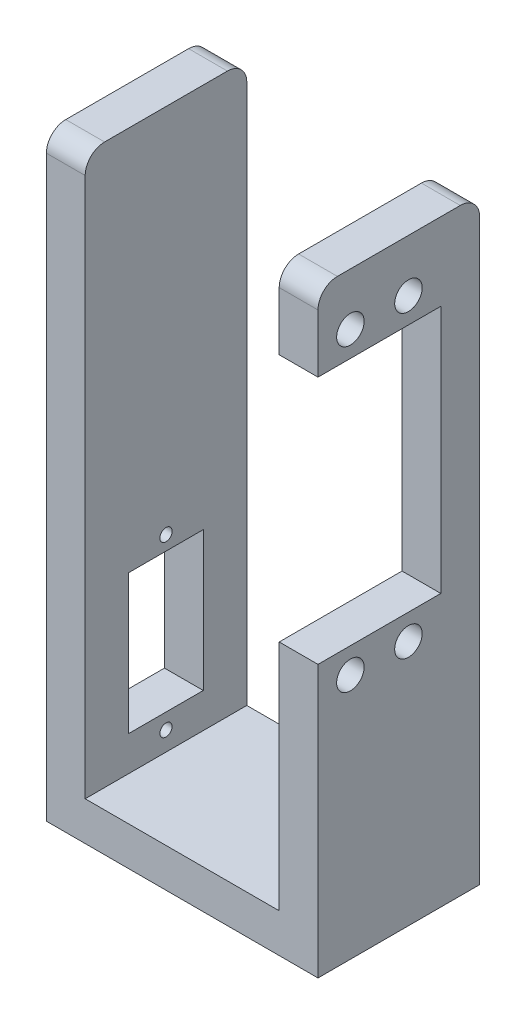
ISO-10303-21;
HEADER;
FILE_DESCRIPTION(('STEP AP214'),'2;1');
FILE_NAME('part.step','',(''),(''),'','','');
FILE_SCHEMA(('AUTOMOTIVE_DESIGN { 1 0 10303 214 1 1 1 1 }'));
ENDSEC;
DATA;
#1=APPLICATION_CONTEXT('core data for automotive mechanical design processes');
#2=APPLICATION_PROTOCOL_DEFINITION('international standard','automotive_design',2000,#1);
#3=PRODUCT_CONTEXT('',#1,'mechanical');
#4=PRODUCT('Part','Part','',(#3));
#5=PRODUCT_RELATED_PRODUCT_CATEGORY('part','',(#4));
#6=PRODUCT_DEFINITION_FORMATION('','',#4);
#7=PRODUCT_DEFINITION_CONTEXT('part definition',#1,'design');
#8=PRODUCT_DEFINITION('design','',#6,#7);
#9=PRODUCT_DEFINITION_SHAPE('','',#8);
#10=(LENGTH_UNIT() NAMED_UNIT(*) SI_UNIT(.MILLI.,.METRE.));
#11=(NAMED_UNIT(*) PLANE_ANGLE_UNIT() SI_UNIT($,.RADIAN.));
#12=(NAMED_UNIT(*) SI_UNIT($,.STERADIAN.) SOLID_ANGLE_UNIT());
#13=UNCERTAINTY_MEASURE_WITH_UNIT(LENGTH_MEASURE(1.E-05),#10,'distance_accuracy_value','');
#14=(GEOMETRIC_REPRESENTATION_CONTEXT(3) GLOBAL_UNCERTAINTY_ASSIGNED_CONTEXT((#13)) GLOBAL_UNIT_ASSIGNED_CONTEXT((#10,
#11,#12)) REPRESENTATION_CONTEXT('',''));
#15=CARTESIAN_POINT('',(0.,0.,0.));
#16=DIRECTION('',(0.,0.,1.));
#17=DIRECTION('',(1.,0.,0.));
#18=AXIS2_PLACEMENT_3D('',#15,#16,#17);
#19=CARTESIAN_POINT('',(-19.6196016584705,-53.6587169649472,-7.0697194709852));
#20=DIRECTION('',(0.,-1.,0.));
#21=DIRECTION('',(0.,0.,-1.));
#22=AXIS2_PLACEMENT_3D('',#19,#20,#21);
#23=PLANE('',#22);
#24=DIRECTION('',(0.,0.,-1.));
#25=VECTOR('',#24,1.);
#26=CARTESIAN_POINT('',(-13.2696016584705,-53.6587169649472,-7.0697194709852));
#27=LINE('',#26,#25);
#28=CARTESIAN_POINT('',(-13.2696016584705,-53.6587169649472,19.3802805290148));
#29=VERTEX_POINT('',#28);
#30=CARTESIAN_POINT('',(-13.2696016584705,-53.6587169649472,-7.0697194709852));
#31=VERTEX_POINT('',#30);
#32=EDGE_CURVE('E208',#29,#31,#27,.T.);
#33=ORIENTED_EDGE('',*,*,#32,.F.);
#34=DIRECTION('',(1.,0.,0.));
#35=VECTOR('',#34,1.);
#36=CARTESIAN_POINT('',(-19.6196016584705,-53.6587169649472,19.3802805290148));
#37=LINE('',#36,#35);
#38=CARTESIAN_POINT('',(18.4803983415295,-53.6587169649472,19.3802805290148));
#39=VERTEX_POINT('',#38);
#40=EDGE_CURVE('E234',#29,#39,#37,.T.);
#41=ORIENTED_EDGE('',*,*,#40,.T.);
#42=DIRECTION('',(0.,0.,-1.));
#43=VECTOR('',#42,1.);
#44=CARTESIAN_POINT('',(18.4803983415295,-53.6587169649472,-7.0697194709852));
#45=LINE('',#44,#43);
#46=CARTESIAN_POINT('',(18.4803983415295,-53.6587169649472,-7.0697194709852));
#47=VERTEX_POINT('',#46);
#48=EDGE_CURVE('E216',#39,#47,#45,.T.);
#49=ORIENTED_EDGE('',*,*,#48,.T.);
#50=DIRECTION('',(1.,0.,0.));
#51=VECTOR('',#50,1.);
#52=CARTESIAN_POINT('',(-19.6196016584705,-53.6587169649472,-7.0697194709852));
#53=LINE('',#52,#51);
#54=EDGE_CURVE('E230',#31,#47,#53,.T.);
#55=ORIENTED_EDGE('',*,*,#54,.F.);
#56=EDGE_LOOP('',(#33,#41,#49,#55));
#57=FACE_BOUND('',#56,.T.);
#58=ADVANCED_FACE('F41',(#57),#23,.F.);
#59=CARTESIAN_POINT('',(18.4803983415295,4.79128303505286,9.33028052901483));
#60=DIRECTION('',(1.,0.,0.));
#61=DIRECTION('',(0.,0.,-1.));
#62=AXIS2_PLACEMENT_3D('',#59,#60,#61);
#63=PLANE('',#62);
#64=CARTESIAN_POINT('',(18.4803983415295,-19.7087169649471,14.0802805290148));
#65=DIRECTION('',(1.,0.,0.));
#66=DIRECTION('',(0.,0.,1.));
#67=AXIS2_PLACEMENT_3D('',#64,#65,#66);
#68=CIRCLE('',#67,2.25);
#69=CARTESIAN_POINT('',(18.4803983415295,-19.7087169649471,16.3302805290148));
#70=VERTEX_POINT('',#69);
#71=EDGE_CURVE('E242',#70,#70,#68,.T.);
#72=ORIENTED_EDGE('',*,*,#71,.T.);
#73=EDGE_LOOP('',(#72));
#74=FACE_BOUND('',#73,.T.);
#75=CARTESIAN_POINT('',(18.4803983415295,-19.7087169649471,4.58028052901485));
#76=DIRECTION('',(1.,0.,0.));
#77=DIRECTION('',(0.,0.,-1.));
#78=AXIS2_PLACEMENT_3D('',#75,#76,#77);
#79=CIRCLE('',#78,2.25);
#80=CARTESIAN_POINT('',(18.4803983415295,-19.7087169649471,2.33028052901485));
#81=VERTEX_POINT('',#80);
#82=EDGE_CURVE('E253',#81,#81,#79,.T.);
#83=ORIENTED_EDGE('',*,*,#82,.T.);
#84=EDGE_LOOP('',(#83));
#85=FACE_BOUND('',#84,.T.);
#86=CARTESIAN_POINT('',(18.4803983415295,29.2912830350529,4.58028052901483));
#87=DIRECTION('',(1.,0.,0.));
#88=DIRECTION('',(0.,0.,1.));
#89=AXIS2_PLACEMENT_3D('',#86,#87,#88);
#90=CIRCLE('',#89,2.25);
#91=CARTESIAN_POINT('',(18.4803983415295,29.2912830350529,6.83028052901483));
#92=VERTEX_POINT('',#91);
#93=EDGE_CURVE('E247',#92,#92,#90,.T.);
#94=ORIENTED_EDGE('',*,*,#93,.T.);
#95=EDGE_LOOP('',(#94));
#96=FACE_BOUND('',#95,.T.);
#97=CARTESIAN_POINT('',(18.4803983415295,29.2912830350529,14.0802805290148));
#98=DIRECTION('',(1.,0.,0.));
#99=DIRECTION('',(0.,0.,-1.));
#100=AXIS2_PLACEMENT_3D('',#97,#98,#99);
#101=CIRCLE('',#100,2.25);
#102=CARTESIAN_POINT('',(18.4803983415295,29.2912830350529,11.8302805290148));
#103=VERTEX_POINT('',#102);
#104=EDGE_CURVE('E261',#103,#103,#101,.T.);
#105=ORIENTED_EDGE('',*,*,#104,.T.);
#106=EDGE_LOOP('',(#105));
#107=FACE_BOUND('',#106,.T.);
#108=ORIENTED_EDGE('',*,*,#48,.F.);
#109=DIRECTION('',(0.,1.,0.));
#110=VECTOR('',#109,1.);
#111=CARTESIAN_POINT('',(18.4803983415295,4.79128303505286,19.3802805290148));
#112=LINE('',#111,#110);
#113=CARTESIAN_POINT('',(18.4803983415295,-15.5587169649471,19.3802805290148));
#114=VERTEX_POINT('',#113);
#115=EDGE_CURVE('E264',#39,#114,#112,.T.);
#116=ORIENTED_EDGE('',*,*,#115,.T.);
#117=DIRECTION('',(0.,0.,-1.));
#118=VECTOR('',#117,1.);
#119=CARTESIAN_POINT('',(18.4803983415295,-15.5587169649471,9.33028052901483));
#120=LINE('',#119,#118);
#121=CARTESIAN_POINT('',(18.4803983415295,-15.5587169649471,-0.719719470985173));
#122=VERTEX_POINT('',#121);
#123=EDGE_CURVE('E270',#114,#122,#120,.T.);
#124=ORIENTED_EDGE('',*,*,#123,.T.);
#125=DIRECTION('',(0.,-1.,0.));
#126=VECTOR('',#125,1.);
#127=CARTESIAN_POINT('',(18.4803983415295,4.79128303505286,-0.719719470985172));
#128=LINE('',#127,#126);
#129=CARTESIAN_POINT('',(18.4803983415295,25.1412830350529,-0.71971947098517));
#130=VERTEX_POINT('',#129);
#131=EDGE_CURVE('E299',#130,#122,#128,.T.);
#132=ORIENTED_EDGE('',*,*,#131,.F.);
#133=DIRECTION('',(0.,0.,-1.));
#134=VECTOR('',#133,1.);
#135=CARTESIAN_POINT('',(18.4803983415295,25.1412830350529,9.33028052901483));
#136=LINE('',#135,#134);
#137=CARTESIAN_POINT('',(18.4803983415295,25.1412830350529,19.3802805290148));
#138=VERTEX_POINT('',#137);
#139=EDGE_CURVE('E297',#138,#130,#136,.T.);
#140=ORIENTED_EDGE('',*,*,#139,.F.);
#141=DIRECTION('',(0.,1.,0.));
#142=VECTOR('',#141,1.);
#143=CARTESIAN_POINT('',(18.4803983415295,4.79128303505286,19.3802805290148));
#144=LINE('',#143,#142);
#145=CARTESIAN_POINT('',(18.4803983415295,34.6662830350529,19.3802805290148));
#146=VERTEX_POINT('',#145);
#147=EDGE_CURVE('E294',#138,#146,#144,.T.);
#148=ORIENTED_EDGE('',*,*,#147,.T.);
#149=CARTESIAN_POINT('',(18.4803983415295,34.6662830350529,16.2052805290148));
#150=DIRECTION('',(1.,0.,0.));
#151=DIRECTION('',(0.,0.,-1.));
#152=AXIS2_PLACEMENT_3D('',#149,#150,#151);
#153=CIRCLE('',#152,3.175);
#154=CARTESIAN_POINT('',(18.4803983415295,37.8412830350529,16.2052805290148));
#155=VERTEX_POINT('',#154);
#156=EDGE_CURVE('E318',#146,#155,#153,.F.);
#157=ORIENTED_EDGE('',*,*,#156,.T.);
#158=DIRECTION('',(0.,0.,-1.));
#159=VECTOR('',#158,1.);
#160=CARTESIAN_POINT('',(18.4803983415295,37.8412830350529,9.33028052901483));
#161=LINE('',#160,#159);
#162=CARTESIAN_POINT('',(18.4803983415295,37.8412830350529,-3.89471947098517));
#163=VERTEX_POINT('',#162);
#164=EDGE_CURVE('E291',#155,#163,#161,.T.);
#165=ORIENTED_EDGE('',*,*,#164,.T.);
#166=CARTESIAN_POINT('',(18.4803983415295,34.6662830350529,-3.89471947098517));
#167=DIRECTION('',(1.,0.,0.));
#168=DIRECTION('',(0.,0.,-1.));
#169=AXIS2_PLACEMENT_3D('',#166,#167,#168);
#170=CIRCLE('',#169,3.175);
#171=CARTESIAN_POINT('',(18.4803983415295,34.6662830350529,-7.06971947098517));
#172=VERTEX_POINT('',#171);
#173=EDGE_CURVE('E320',#163,#172,#170,.F.);
#174=ORIENTED_EDGE('',*,*,#173,.T.);
#175=DIRECTION('',(0.,-1.,0.));
#176=VECTOR('',#175,1.);
#177=CARTESIAN_POINT('',(18.4803983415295,4.79128303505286,-7.06971947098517));
#178=LINE('',#177,#176);
#179=EDGE_CURVE('E288',#172,#47,#178,.T.);
#180=ORIENTED_EDGE('',*,*,#179,.T.);
#181=EDGE_LOOP('',(#108,#116,#124,#132,#140,#148,#157,#165,#174,#180));
#182=FACE_BOUND('',#181,.T.);
#183=ADVANCED_FACE('F414',(#74,#85,#96,#107,#182),#63,.F.);
#184=CARTESIAN_POINT('',(24.8303983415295,4.79128303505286,19.3802805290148));
#185=DIRECTION('',(0.,0.,1.));
#186=DIRECTION('',(1.,0.,0.));
#187=AXIS2_PLACEMENT_3D('',#184,#185,#186);
#188=PLANE('',#187);
#189=DIRECTION('',(0.,-1.,0.));
#190=VECTOR('',#189,1.);
#191=CARTESIAN_POINT('',(-13.2696016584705,65.0428454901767,19.3802805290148));
#192=LINE('',#191,#190);
#193=CARTESIAN_POINT('',(-13.2696016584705,34.6662830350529,19.3802805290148));
#194=VERTEX_POINT('',#193);
#195=EDGE_CURVE('E212',#194,#29,#192,.T.);
#196=ORIENTED_EDGE('',*,*,#195,.F.);
#197=DIRECTION('',(1.,0.,0.));
#198=VECTOR('',#197,1.);
#199=CARTESIAN_POINT('',(24.8303983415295,34.6662830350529,19.3802805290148));
#200=LINE('',#199,#198);
#201=CARTESIAN_POINT('',(-19.6196016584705,34.6662830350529,19.3802805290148));
#202=VERTEX_POINT('',#201);
#203=EDGE_CURVE('E341',#194,#202,#200,.F.);
#204=ORIENTED_EDGE('',*,*,#203,.T.);
#205=DIRECTION('',(0.,1.,0.));
#206=VECTOR('',#205,1.);
#207=CARTESIAN_POINT('',(-19.6196016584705,-60.0087169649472,19.3802805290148));
#208=LINE('',#207,#206);
#209=CARTESIAN_POINT('',(-19.6196016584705,-60.0087169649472,19.3802805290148));
#210=VERTEX_POINT('',#209);
#211=EDGE_CURVE('E227',#210,#202,#208,.T.);
#212=ORIENTED_EDGE('',*,*,#211,.F.);
#213=DIRECTION('',(-1.,0.,0.));
#214=VECTOR('',#213,1.);
#215=CARTESIAN_POINT('',(18.4803983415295,-60.0087169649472,19.3802805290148));
#216=LINE('',#215,#214);
#217=CARTESIAN_POINT('',(24.8303983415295,-60.0087169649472,19.3802805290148));
#218=VERTEX_POINT('',#217);
#219=EDGE_CURVE('E240',#218,#210,#216,.T.);
#220=ORIENTED_EDGE('',*,*,#219,.F.);
#221=DIRECTION('',(0.,1.,0.));
#222=VECTOR('',#221,1.);
#223=CARTESIAN_POINT('',(24.8303983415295,4.79128303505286,19.3802805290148));
#224=LINE('',#223,#222);
#225=CARTESIAN_POINT('',(24.8303983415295,-15.5587169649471,19.3802805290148));
#226=VERTEX_POINT('',#225);
#227=EDGE_CURVE('E267',#218,#226,#224,.T.);
#228=ORIENTED_EDGE('',*,*,#227,.T.);
#229=DIRECTION('',(-1.,0.,0.));
#230=VECTOR('',#229,1.);
#231=CARTESIAN_POINT('',(24.8303983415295,-15.5587169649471,19.3802805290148));
#232=LINE('',#231,#230);
#233=EDGE_CURVE('E286',#226,#114,#232,.T.);
#234=ORIENTED_EDGE('',*,*,#233,.T.);
#235=ORIENTED_EDGE('',*,*,#115,.F.);
#236=ORIENTED_EDGE('',*,*,#40,.F.);
#237=EDGE_LOOP('',(#196,#204,#212,#220,#228,#234,#235,#236));
#238=FACE_BOUND('',#237,.T.);
#239=ADVANCED_FACE('F400',(#238),#188,.T.);
#240=CARTESIAN_POINT('',(24.8303983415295,4.79128303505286,-7.06971947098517));
#241=DIRECTION('',(0.,0.,-1.));
#242=DIRECTION('',(0.,1.,0.));
#243=AXIS2_PLACEMENT_3D('',#240,#241,#242);
#244=PLANE('',#243);
#245=DIRECTION('',(0.,-1.,0.));
#246=VECTOR('',#245,1.);
#247=CARTESIAN_POINT('',(-19.6196016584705,-60.0087169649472,-7.0697194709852));
#248=LINE('',#247,#246);
#249=CARTESIAN_POINT('',(-19.6196016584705,34.6662830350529,-7.0697194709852));
#250=VERTEX_POINT('',#249);
#251=CARTESIAN_POINT('',(-19.6196016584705,-60.0087169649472,-7.0697194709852));
#252=VERTEX_POINT('',#251);
#253=EDGE_CURVE('E222',#250,#252,#248,.T.);
#254=ORIENTED_EDGE('',*,*,#253,.F.);
#255=DIRECTION('',(-1.,0.,0.));
#256=VECTOR('',#255,1.);
#257=CARTESIAN_POINT('',(24.8303983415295,34.6662830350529,-7.06971947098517));
#258=LINE('',#257,#256);
#259=CARTESIAN_POINT('',(-13.2696016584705,34.6662830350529,-7.0697194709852));
#260=VERTEX_POINT('',#259);
#261=EDGE_CURVE('E347',#250,#260,#258,.F.);
#262=ORIENTED_EDGE('',*,*,#261,.T.);
#263=DIRECTION('',(0.,-1.,0.));
#264=VECTOR('',#263,1.);
#265=CARTESIAN_POINT('',(-13.2696016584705,65.0428454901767,-7.0697194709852));
#266=LINE('',#265,#264);
#267=EDGE_CURVE('E211',#260,#31,#266,.T.);
#268=ORIENTED_EDGE('',*,*,#267,.T.);
#269=ORIENTED_EDGE('',*,*,#54,.T.);
#270=ORIENTED_EDGE('',*,*,#179,.F.);
#271=DIRECTION('',(-1.,0.,0.));
#272=VECTOR('',#271,1.);
#273=CARTESIAN_POINT('',(24.8303983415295,34.6662830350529,-7.06971947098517));
#274=LINE('',#273,#272);
#275=CARTESIAN_POINT('',(24.8303983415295,34.6662830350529,-7.06971947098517));
#276=VERTEX_POINT('',#275);
#277=EDGE_CURVE('E322',#172,#276,#274,.F.);
#278=ORIENTED_EDGE('',*,*,#277,.T.);
#279=DIRECTION('',(0.,-1.,0.));
#280=VECTOR('',#279,1.);
#281=CARTESIAN_POINT('',(24.8303983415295,4.79128303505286,-7.06971947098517));
#282=LINE('',#281,#280);
#283=CARTESIAN_POINT('',(24.8303983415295,-60.0087169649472,-7.0697194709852));
#284=VERTEX_POINT('',#283);
#285=EDGE_CURVE('E269',#276,#284,#282,.T.);
#286=ORIENTED_EDGE('',*,*,#285,.T.);
#287=DIRECTION('',(1.,0.,0.));
#288=VECTOR('',#287,1.);
#289=CARTESIAN_POINT('',(18.4803983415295,-60.0087169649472,-7.0697194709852));
#290=LINE('',#289,#288);
#291=EDGE_CURVE('E236',#252,#284,#290,.T.);
#292=ORIENTED_EDGE('',*,*,#291,.F.);
#293=EDGE_LOOP('',(#254,#262,#268,#269,#270,#278,#286,#292));
#294=FACE_BOUND('',#293,.T.);
#295=ADVANCED_FACE('F390',(#294),#244,.T.);
#296=CARTESIAN_POINT('',(24.8303983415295,4.79128303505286,9.33028052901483));
#297=DIRECTION('',(1.,0.,0.));
#298=DIRECTION('',(0.,0.,-1.));
#299=AXIS2_PLACEMENT_3D('',#296,#297,#298);
#300=PLANE('',#299);
#301=CARTESIAN_POINT('',(24.8303983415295,-19.7087169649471,14.0802805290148));
#302=DIRECTION('',(1.,0.,0.));
#303=DIRECTION('',(0.,0.,1.));
#304=AXIS2_PLACEMENT_3D('',#301,#302,#303);
#305=CIRCLE('',#304,2.25);
#306=CARTESIAN_POINT('',(24.8303983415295,-19.7087169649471,16.3302805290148));
#307=VERTEX_POINT('',#306);
#308=EDGE_CURVE('E256',#307,#307,#305,.T.);
#309=ORIENTED_EDGE('',*,*,#308,.F.);
#310=EDGE_LOOP('',(#309));
#311=FACE_BOUND('',#310,.T.);
#312=CARTESIAN_POINT('',(24.8303983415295,-19.7087169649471,4.58028052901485));
#313=DIRECTION('',(1.,0.,0.));
#314=DIRECTION('',(0.,0.,-1.));
#315=AXIS2_PLACEMENT_3D('',#312,#313,#314);
#316=CIRCLE('',#315,2.25);
#317=CARTESIAN_POINT('',(24.8303983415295,-19.7087169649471,2.33028052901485));
#318=VERTEX_POINT('',#317);
#319=EDGE_CURVE('E250',#318,#318,#316,.T.);
#320=ORIENTED_EDGE('',*,*,#319,.F.);
#321=EDGE_LOOP('',(#320));
#322=FACE_BOUND('',#321,.T.);
#323=CARTESIAN_POINT('',(24.8303983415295,29.2912830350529,4.58028052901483));
#324=DIRECTION('',(1.,0.,0.));
#325=DIRECTION('',(0.,0.,1.));
#326=AXIS2_PLACEMENT_3D('',#323,#324,#325);
#327=CIRCLE('',#326,2.25);
#328=CARTESIAN_POINT('',(24.8303983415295,29.2912830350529,6.83028052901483));
#329=VERTEX_POINT('',#328);
#330=EDGE_CURVE('E243',#329,#329,#327,.T.);
#331=ORIENTED_EDGE('',*,*,#330,.F.);
#332=EDGE_LOOP('',(#331));
#333=FACE_BOUND('',#332,.T.);
#334=CARTESIAN_POINT('',(24.8303983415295,29.2912830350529,14.0802805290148));
#335=DIRECTION('',(1.,0.,0.));
#336=DIRECTION('',(0.,0.,-1.));
#337=AXIS2_PLACEMENT_3D('',#334,#335,#336);
#338=CIRCLE('',#337,2.25);
#339=CARTESIAN_POINT('',(24.8303983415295,29.2912830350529,11.8302805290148));
#340=VERTEX_POINT('',#339);
#341=EDGE_CURVE('E246',#340,#340,#338,.T.);
#342=ORIENTED_EDGE('',*,*,#341,.F.);
#343=EDGE_LOOP('',(#342));
#344=FACE_BOUND('',#343,.T.);
#345=ORIENTED_EDGE('',*,*,#227,.F.);
#346=DIRECTION('',(0.,0.,1.));
#347=VECTOR('',#346,1.);
#348=CARTESIAN_POINT('',(24.8303983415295,-60.0087169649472,19.3802805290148));
#349=LINE('',#348,#347);
#350=EDGE_CURVE('E238',#284,#218,#349,.T.);
#351=ORIENTED_EDGE('',*,*,#350,.F.);
#352=ORIENTED_EDGE('',*,*,#285,.F.);
#353=CARTESIAN_POINT('',(24.8303983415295,34.6662830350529,-3.89471947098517));
#354=DIRECTION('',(1.,0.,0.));
#355=DIRECTION('',(0.,0.,-1.));
#356=AXIS2_PLACEMENT_3D('',#353,#354,#355);
#357=CIRCLE('',#356,3.175);
#358=CARTESIAN_POINT('',(24.8303983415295,37.8412830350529,-3.89471947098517));
#359=VERTEX_POINT('',#358);
#360=EDGE_CURVE('E326',#276,#359,#357,.T.);
#361=ORIENTED_EDGE('',*,*,#360,.T.);
#362=DIRECTION('',(0.,0.,-1.));
#363=VECTOR('',#362,1.);
#364=CARTESIAN_POINT('',(24.8303983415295,37.8412830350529,9.33028052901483));
#365=LINE('',#364,#363);
#366=CARTESIAN_POINT('',(24.8303983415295,37.8412830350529,16.2052805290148));
#367=VERTEX_POINT('',#366);
#368=EDGE_CURVE('E273',#367,#359,#365,.T.);
#369=ORIENTED_EDGE('',*,*,#368,.F.);
#370=CARTESIAN_POINT('',(24.8303983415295,34.6662830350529,16.2052805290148));
#371=DIRECTION('',(1.,0.,0.));
#372=DIRECTION('',(0.,0.,-1.));
#373=AXIS2_PLACEMENT_3D('',#370,#371,#372);
#374=CIRCLE('',#373,3.175);
#375=CARTESIAN_POINT('',(24.8303983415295,34.6662830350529,19.3802805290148));
#376=VERTEX_POINT('',#375);
#377=EDGE_CURVE('E324',#367,#376,#374,.T.);
#378=ORIENTED_EDGE('',*,*,#377,.T.);
#379=DIRECTION('',(0.,1.,0.));
#380=VECTOR('',#379,1.);
#381=CARTESIAN_POINT('',(24.8303983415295,4.79128303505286,19.3802805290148));
#382=LINE('',#381,#380);
#383=CARTESIAN_POINT('',(24.8303983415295,25.1412830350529,19.3802805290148));
#384=VERTEX_POINT('',#383);
#385=EDGE_CURVE('E276',#384,#376,#382,.T.);
#386=ORIENTED_EDGE('',*,*,#385,.F.);
#387=DIRECTION('',(0.,0.,-1.));
#388=VECTOR('',#387,1.);
#389=CARTESIAN_POINT('',(24.8303983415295,25.1412830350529,9.33028052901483));
#390=LINE('',#389,#388);
#391=CARTESIAN_POINT('',(24.8303983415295,25.1412830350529,-0.71971947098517));
#392=VERTEX_POINT('',#391);
#393=EDGE_CURVE('E279',#384,#392,#390,.T.);
#394=ORIENTED_EDGE('',*,*,#393,.T.);
#395=DIRECTION('',(0.,-1.,0.));
#396=VECTOR('',#395,1.);
#397=CARTESIAN_POINT('',(24.8303983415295,4.79128303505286,-0.719719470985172));
#398=LINE('',#397,#396);
#399=CARTESIAN_POINT('',(24.8303983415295,-15.5587169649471,-0.719719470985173));
#400=VERTEX_POINT('',#399);
#401=EDGE_CURVE('E281',#392,#400,#398,.T.);
#402=ORIENTED_EDGE('',*,*,#401,.T.);
#403=DIRECTION('',(0.,0.,-1.));
#404=VECTOR('',#403,1.);
#405=CARTESIAN_POINT('',(24.8303983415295,-15.5587169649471,9.33028052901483));
#406=LINE('',#405,#404);
#407=EDGE_CURVE('E283',#226,#400,#406,.T.);
#408=ORIENTED_EDGE('',*,*,#407,.F.);
#409=EDGE_LOOP('',(#345,#351,#352,#361,#369,#378,#386,#394,#402,#408));
#410=FACE_BOUND('',#409,.T.);
#411=ADVANCED_FACE('F446',(#311,#322,#333,#344,#410),#300,.T.);
#412=CARTESIAN_POINT('',(24.8303983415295,37.8412830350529,9.33028052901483));
#413=DIRECTION('',(0.,1.,0.));
#414=DIRECTION('',(0.,0.,1.));
#415=AXIS2_PLACEMENT_3D('',#412,#413,#414);
#416=PLANE('',#415);
#417=ORIENTED_EDGE('',*,*,#368,.T.);
#418=DIRECTION('',(-1.,0.,0.));
#419=VECTOR('',#418,1.);
#420=CARTESIAN_POINT('',(24.8303983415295,37.8412830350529,-3.89471947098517));
#421=LINE('',#420,#419);
#422=EDGE_CURVE('E315',#359,#163,#421,.T.);
#423=ORIENTED_EDGE('',*,*,#422,.T.);
#424=ORIENTED_EDGE('',*,*,#164,.F.);
#425=DIRECTION('',(-1.,0.,0.));
#426=VECTOR('',#425,1.);
#427=CARTESIAN_POINT('',(24.8303983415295,37.8412830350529,16.2052805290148));
#428=LINE('',#427,#426);
#429=EDGE_CURVE('E313',#155,#367,#428,.F.);
#430=ORIENTED_EDGE('',*,*,#429,.T.);
#431=EDGE_LOOP('',(#417,#423,#424,#430));
#432=FACE_BOUND('',#431,.T.);
#433=ADVANCED_FACE('F448',(#432),#416,.T.);
#434=CARTESIAN_POINT('',(24.8303983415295,4.79128303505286,19.3802805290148));
#435=DIRECTION('',(0.,0.,1.));
#436=DIRECTION('',(0.,-1.,0.));
#437=AXIS2_PLACEMENT_3D('',#434,#435,#436);
#438=PLANE('',#437);
#439=ORIENTED_EDGE('',*,*,#385,.T.);
#440=DIRECTION('',(-1.,0.,0.));
#441=VECTOR('',#440,1.);
#442=CARTESIAN_POINT('',(24.8303983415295,34.6662830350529,19.3802805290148));
#443=LINE('',#442,#441);
#444=EDGE_CURVE('E328',#376,#146,#443,.T.);
#445=ORIENTED_EDGE('',*,*,#444,.T.);
#446=ORIENTED_EDGE('',*,*,#147,.F.);
#447=DIRECTION('',(-1.,0.,0.));
#448=VECTOR('',#447,1.);
#449=CARTESIAN_POINT('',(24.8303983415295,25.1412830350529,19.3802805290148));
#450=LINE('',#449,#448);
#451=EDGE_CURVE('E311',#384,#138,#450,.T.);
#452=ORIENTED_EDGE('',*,*,#451,.F.);
#453=EDGE_LOOP('',(#439,#445,#446,#452));
#454=FACE_BOUND('',#453,.T.);
#455=ADVANCED_FACE('F461',(#454),#438,.T.);
#456=CARTESIAN_POINT('',(24.8303983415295,25.1412830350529,9.33028052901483));
#457=DIRECTION('',(0.,1.,0.));
#458=DIRECTION('',(0.,0.,1.));
#459=AXIS2_PLACEMENT_3D('',#456,#457,#458);
#460=PLANE('',#459);
#461=ORIENTED_EDGE('',*,*,#139,.T.);
#462=DIRECTION('',(-1.,0.,0.));
#463=VECTOR('',#462,1.);
#464=CARTESIAN_POINT('',(24.8303983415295,25.1412830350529,-0.71971947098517));
#465=LINE('',#464,#463);
#466=EDGE_CURVE('E308',#392,#130,#465,.T.);
#467=ORIENTED_EDGE('',*,*,#466,.F.);
#468=ORIENTED_EDGE('',*,*,#393,.F.);
#469=ORIENTED_EDGE('',*,*,#451,.T.);
#470=EDGE_LOOP('',(#461,#467,#468,#469));
#471=FACE_BOUND('',#470,.T.);
#472=ADVANCED_FACE('F457',(#471),#460,.F.);
#473=CARTESIAN_POINT('',(24.8303983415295,4.79128303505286,-0.719719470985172));
#474=DIRECTION('',(0.,0.,-1.));
#475=DIRECTION('',(0.,1.,0.));
#476=AXIS2_PLACEMENT_3D('',#473,#474,#475);
#477=PLANE('',#476);
#478=ORIENTED_EDGE('',*,*,#131,.T.);
#479=DIRECTION('',(-1.,0.,0.));
#480=VECTOR('',#479,1.);
#481=CARTESIAN_POINT('',(24.8303983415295,-15.5587169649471,-0.719719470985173));
#482=LINE('',#481,#480);
#483=EDGE_CURVE('E306',#400,#122,#482,.T.);
#484=ORIENTED_EDGE('',*,*,#483,.F.);
#485=ORIENTED_EDGE('',*,*,#401,.F.);
#486=ORIENTED_EDGE('',*,*,#466,.T.);
#487=EDGE_LOOP('',(#478,#484,#485,#486));
#488=FACE_BOUND('',#487,.T.);
#489=ADVANCED_FACE('F453',(#488),#477,.F.);
#490=CARTESIAN_POINT('',(24.8303983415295,-15.5587169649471,9.33028052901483));
#491=DIRECTION('',(0.,1.,0.));
#492=DIRECTION('',(0.,0.,1.));
#493=AXIS2_PLACEMENT_3D('',#490,#491,#492);
#494=PLANE('',#493);
#495=ORIENTED_EDGE('',*,*,#123,.F.);
#496=ORIENTED_EDGE('',*,*,#233,.F.);
#497=ORIENTED_EDGE('',*,*,#407,.T.);
#498=ORIENTED_EDGE('',*,*,#483,.T.);
#499=EDGE_LOOP('',(#495,#496,#497,#498));
#500=FACE_BOUND('',#499,.T.);
#501=ADVANCED_FACE('F444',(#500),#494,.T.);
#502=CARTESIAN_POINT('',(18.4803983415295,29.2912830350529,14.0802805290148));
#503=DIRECTION('',(1.,0.,0.));
#504=DIRECTION('',(0.,0.,-1.));
#505=AXIS2_PLACEMENT_3D('',#502,#503,#504);
#506=CYLINDRICAL_SURFACE('',#505,2.25);
#507=ORIENTED_EDGE('',*,*,#104,.F.);
#508=EDGE_LOOP('',(#507));
#509=FACE_BOUND('',#508,.T.);
#510=ORIENTED_EDGE('',*,*,#341,.T.);
#511=EDGE_LOOP('',(#510));
#512=FACE_BOUND('',#511,.T.);
#513=ADVANCED_FACE('F432',(#509,#512),#506,.F.);
#514=CARTESIAN_POINT('',(18.4803983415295,29.2912830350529,4.58028052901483));
#515=DIRECTION('',(1.,0.,0.));
#516=DIRECTION('',(0.,0.,-1.));
#517=AXIS2_PLACEMENT_3D('',#514,#515,#516);
#518=CYLINDRICAL_SURFACE('',#517,2.25);
#519=ORIENTED_EDGE('',*,*,#93,.F.);
#520=EDGE_LOOP('',(#519));
#521=FACE_BOUND('',#520,.T.);
#522=ORIENTED_EDGE('',*,*,#330,.T.);
#523=EDGE_LOOP('',(#522));
#524=FACE_BOUND('',#523,.T.);
#525=ADVANCED_FACE('F428',(#521,#524),#518,.F.);
#526=CARTESIAN_POINT('',(18.4803983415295,-19.7087169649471,4.58028052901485));
#527=DIRECTION('',(1.,0.,0.));
#528=DIRECTION('',(0.,0.,-1.));
#529=AXIS2_PLACEMENT_3D('',#526,#527,#528);
#530=CYLINDRICAL_SURFACE('',#529,2.25);
#531=ORIENTED_EDGE('',*,*,#82,.F.);
#532=EDGE_LOOP('',(#531));
#533=FACE_BOUND('',#532,.T.);
#534=ORIENTED_EDGE('',*,*,#319,.T.);
#535=EDGE_LOOP('',(#534));
#536=FACE_BOUND('',#535,.T.);
#537=ADVANCED_FACE('F431',(#533,#536),#530,.F.);
#538=CARTESIAN_POINT('',(18.4803983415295,-19.7087169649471,14.0802805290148));
#539=DIRECTION('',(1.,0.,0.));
#540=DIRECTION('',(0.,0.,-1.));
#541=AXIS2_PLACEMENT_3D('',#538,#539,#540);
#542=CYLINDRICAL_SURFACE('',#541,2.25);
#543=ORIENTED_EDGE('',*,*,#71,.F.);
#544=EDGE_LOOP('',(#543));
#545=FACE_BOUND('',#544,.T.);
#546=ORIENTED_EDGE('',*,*,#308,.T.);
#547=EDGE_LOOP('',(#546));
#548=FACE_BOUND('',#547,.T.);
#549=ADVANCED_FACE('F436',(#545,#548),#542,.F.);
#550=CARTESIAN_POINT('',(24.8303983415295,34.6662830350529,-3.89471947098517));
#551=DIRECTION('',(-1.,0.,0.));
#552=DIRECTION('',(0.,0.,1.));
#553=AXIS2_PLACEMENT_3D('',#550,#551,#552);
#554=CYLINDRICAL_SURFACE('',#553,3.175);
#555=ORIENTED_EDGE('',*,*,#360,.F.);
#556=ORIENTED_EDGE('',*,*,#277,.F.);
#557=ORIENTED_EDGE('',*,*,#173,.F.);
#558=ORIENTED_EDGE('',*,*,#422,.F.);
#559=EDGE_LOOP('',(#555,#556,#557,#558));
#560=FACE_BOUND('',#559,.T.);
#561=ADVANCED_FACE('F440',(#560),#554,.T.);
#562=CARTESIAN_POINT('',(24.8303983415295,34.6662830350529,16.2052805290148));
#563=DIRECTION('',(-1.,0.,0.));
#564=DIRECTION('',(0.,0.,1.));
#565=AXIS2_PLACEMENT_3D('',#562,#563,#564);
#566=CYLINDRICAL_SURFACE('',#565,3.175);
#567=ORIENTED_EDGE('',*,*,#377,.F.);
#568=ORIENTED_EDGE('',*,*,#429,.F.);
#569=ORIENTED_EDGE('',*,*,#156,.F.);
#570=ORIENTED_EDGE('',*,*,#444,.F.);
#571=EDGE_LOOP('',(#567,#568,#569,#570));
#572=FACE_BOUND('',#571,.T.);
#573=ADVANCED_FACE('F427',(#572),#566,.T.);
#574=CARTESIAN_POINT('',(18.4803983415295,-60.0087169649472,9.33028052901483));
#575=DIRECTION('',(0.,-1.,0.));
#576=DIRECTION('',(0.,0.,-1.));
#577=AXIS2_PLACEMENT_3D('',#574,#575,#576);
#578=PLANE('',#577);
#579=ORIENTED_EDGE('',*,*,#219,.T.);
#580=DIRECTION('',(0.,0.,1.));
#581=VECTOR('',#580,1.);
#582=CARTESIAN_POINT('',(-19.6196016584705,-60.0087169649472,-7.0697194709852));
#583=LINE('',#582,#581);
#584=EDGE_CURVE('E224',#252,#210,#583,.T.);
#585=ORIENTED_EDGE('',*,*,#584,.F.);
#586=ORIENTED_EDGE('',*,*,#291,.T.);
#587=ORIENTED_EDGE('',*,*,#350,.T.);
#588=EDGE_LOOP('',(#579,#585,#586,#587));
#589=FACE_BOUND('',#588,.T.);
#590=ADVANCED_FACE('F395',(#589),#578,.T.);
#591=CARTESIAN_POINT('',(-19.6196016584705,4.79128303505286,9.33028052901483));
#592=DIRECTION('',(1.,0.,0.));
#593=DIRECTION('',(0.,0.,-1.));
#594=AXIS2_PLACEMENT_3D('',#591,#592,#593);
#595=PLANE('',#594);
#596=CARTESIAN_POINT('',(-19.6196016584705,-50.5193704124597,6.15528052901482));
#597=DIRECTION('',(-1.,0.,0.));
#598=DIRECTION('',(0.,0.,1.));
#599=AXIS2_PLACEMENT_3D('',#596,#597,#598);
#600=CIRCLE('',#599,1.);
#601=CARTESIAN_POINT('',(-19.6196016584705,-50.5193704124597,7.15528052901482));
#602=VERTEX_POINT('',#601);
#603=EDGE_CURVE('E203',#602,#602,#600,.T.);
#604=ORIENTED_EDGE('',*,*,#603,.F.);
#605=EDGE_LOOP('',(#604));
#606=FACE_BOUND('',#605,.T.);
#607=CARTESIAN_POINT('',(-19.6196016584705,-22.8343471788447,6.15528052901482));
#608=DIRECTION('',(-1.,0.,0.));
#609=DIRECTION('',(0.,0.,1.));
#610=AXIS2_PLACEMENT_3D('',#607,#608,#609);
#611=CIRCLE('',#610,1.0097264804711);
#612=CARTESIAN_POINT('',(-19.6196016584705,-22.8343471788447,7.16500700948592));
#613=VERTEX_POINT('',#612);
#614=EDGE_CURVE('E200',#613,#613,#611,.T.);
#615=ORIENTED_EDGE('',*,*,#614,.F.);
#616=EDGE_LOOP('',(#615));
#617=FACE_BOUND('',#616,.T.);
#618=DIRECTION('',(0.,0.,-1.));
#619=VECTOR('',#618,1.);
#620=CARTESIAN_POINT('',(-19.6196016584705,-25.1745141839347,0.0552805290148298));
#621=LINE('',#620,#619);
#622=CARTESIAN_POINT('',(-19.6196016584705,-25.1745141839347,12.2552805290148));
#623=VERTEX_POINT('',#622);
#624=CARTESIAN_POINT('',(-19.6196016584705,-25.1745141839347,0.0552805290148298));
#625=VERTEX_POINT('',#624);
#626=EDGE_CURVE('E199',#623,#625,#621,.T.);
#627=ORIENTED_EDGE('',*,*,#626,.F.);
#628=DIRECTION('',(0.,1.,0.));
#629=VECTOR('',#628,1.);
#630=CARTESIAN_POINT('',(-19.6196016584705,-25.1745141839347,12.2552805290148));
#631=LINE('',#630,#629);
#632=CARTESIAN_POINT('',(-19.6196016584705,-47.9745141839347,12.2552805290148));
#633=VERTEX_POINT('',#632);
#634=EDGE_CURVE('E58',#633,#623,#631,.T.);
#635=ORIENTED_EDGE('',*,*,#634,.F.);
#636=DIRECTION('',(0.,0.,1.));
#637=VECTOR('',#636,1.);
#638=CARTESIAN_POINT('',(-19.6196016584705,-47.9745141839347,0.0552805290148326));
#639=LINE('',#638,#637);
#640=CARTESIAN_POINT('',(-19.6196016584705,-47.9745141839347,0.0552805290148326));
#641=VERTEX_POINT('',#640);
#642=EDGE_CURVE('E187',#641,#633,#639,.T.);
#643=ORIENTED_EDGE('',*,*,#642,.F.);
#644=DIRECTION('',(0.,-1.,0.));
#645=VECTOR('',#644,1.);
#646=CARTESIAN_POINT('',(-19.6196016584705,-25.1745141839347,0.0552805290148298));
#647=LINE('',#646,#645);
#648=EDGE_CURVE('E193',#625,#641,#647,.T.);
#649=ORIENTED_EDGE('',*,*,#648,.F.);
#650=EDGE_LOOP('',(#627,#635,#643,#649));
#651=FACE_BOUND('',#650,.T.);
#652=ORIENTED_EDGE('',*,*,#211,.T.);
#653=CARTESIAN_POINT('',(-19.6196016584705,34.6662830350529,16.2052805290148));
#654=DIRECTION('',(1.,0.,0.));
#655=DIRECTION('',(0.,0.,-1.));
#656=AXIS2_PLACEMENT_3D('',#653,#654,#655);
#657=CIRCLE('',#656,3.175);
#658=CARTESIAN_POINT('',(-19.6196016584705,37.8412830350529,16.2052805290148));
#659=VERTEX_POINT('',#658);
#660=EDGE_CURVE('E345',#202,#659,#657,.F.);
#661=ORIENTED_EDGE('',*,*,#660,.T.);
#662=DIRECTION('',(0.,0.,1.));
#663=VECTOR('',#662,1.);
#664=CARTESIAN_POINT('',(-19.6196016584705,37.8412830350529,-7.0697194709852));
#665=LINE('',#664,#663);
#666=CARTESIAN_POINT('',(-19.6196016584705,37.8412830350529,-3.89471947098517));
#667=VERTEX_POINT('',#666);
#668=EDGE_CURVE('E217',#667,#659,#665,.T.);
#669=ORIENTED_EDGE('',*,*,#668,.F.);
#670=CARTESIAN_POINT('',(-19.6196016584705,34.6662830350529,-3.89471947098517));
#671=DIRECTION('',(1.,0.,0.));
#672=DIRECTION('',(0.,0.,-1.));
#673=AXIS2_PLACEMENT_3D('',#670,#671,#672);
#674=CIRCLE('',#673,3.175);
#675=EDGE_CURVE('E343',#667,#250,#674,.F.);
#676=ORIENTED_EDGE('',*,*,#675,.T.);
#677=ORIENTED_EDGE('',*,*,#253,.T.);
#678=ORIENTED_EDGE('',*,*,#584,.T.);
#679=EDGE_LOOP('',(#652,#661,#669,#676,#677,#678));
#680=FACE_BOUND('',#679,.T.);
#681=ADVANCED_FACE('F197',(#606,#617,#651,#680),#595,.F.);
#682=CARTESIAN_POINT('',(-13.2696016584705,65.0428454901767,-7.0697194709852));
#683=DIRECTION('',(-1.,0.,0.));
#684=DIRECTION('',(0.,0.,1.));
#685=AXIS2_PLACEMENT_3D('',#682,#683,#684);
#686=PLANE('',#685);
#687=CARTESIAN_POINT('',(-13.2696016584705,-50.5193704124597,6.15528052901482));
#688=DIRECTION('',(-1.,0.,0.));
#689=DIRECTION('',(0.,0.,1.));
#690=AXIS2_PLACEMENT_3D('',#687,#688,#689);
#691=CIRCLE('',#690,1.);
#692=CARTESIAN_POINT('',(-13.2696016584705,-50.5193704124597,7.15528052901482));
#693=VERTEX_POINT('',#692);
#694=EDGE_CURVE('E45',#693,#693,#691,.T.);
#695=ORIENTED_EDGE('',*,*,#694,.T.);
#696=EDGE_LOOP('',(#695));
#697=FACE_BOUND('',#696,.T.);
#698=CARTESIAN_POINT('',(-13.2696016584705,-22.8343471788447,6.15528052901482));
#699=DIRECTION('',(-1.,0.,0.));
#700=DIRECTION('',(0.,0.,1.));
#701=AXIS2_PLACEMENT_3D('',#698,#699,#700);
#702=CIRCLE('',#701,1.0097264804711);
#703=CARTESIAN_POINT('',(-13.2696016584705,-22.8343471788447,7.16500700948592));
#704=VERTEX_POINT('',#703);
#705=EDGE_CURVE('E355',#704,#704,#702,.T.);
#706=ORIENTED_EDGE('',*,*,#705,.T.);
#707=EDGE_LOOP('',(#706));
#708=FACE_BOUND('',#707,.T.);
#709=DIRECTION('',(0.,0.,1.));
#710=VECTOR('',#709,1.);
#711=CARTESIAN_POINT('',(-13.2696016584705,-47.9745141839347,-7.0697194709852));
#712=LINE('',#711,#710);
#713=CARTESIAN_POINT('',(-13.2696016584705,-47.9745141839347,0.0552805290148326));
#714=VERTEX_POINT('',#713);
#715=CARTESIAN_POINT('',(-13.2696016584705,-47.9745141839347,12.2552805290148));
#716=VERTEX_POINT('',#715);
#717=EDGE_CURVE('E50',#714,#716,#712,.T.);
#718=ORIENTED_EDGE('',*,*,#717,.T.);
#719=DIRECTION('',(0.,1.,0.));
#720=VECTOR('',#719,1.);
#721=CARTESIAN_POINT('',(-13.2696016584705,65.0428454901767,12.2552805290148));
#722=LINE('',#721,#720);
#723=CARTESIAN_POINT('',(-13.2696016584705,-25.1745141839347,12.2552805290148));
#724=VERTEX_POINT('',#723);
#725=EDGE_CURVE('E11',#716,#724,#722,.T.);
#726=ORIENTED_EDGE('',*,*,#725,.T.);
#727=DIRECTION('',(0.,0.,-1.));
#728=VECTOR('',#727,1.);
#729=CARTESIAN_POINT('',(-13.2696016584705,-25.1745141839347,-7.0697194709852));
#730=LINE('',#729,#728);
#731=CARTESIAN_POINT('',(-13.2696016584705,-25.1745141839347,0.0552805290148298));
#732=VERTEX_POINT('',#731);
#733=EDGE_CURVE('E349',#724,#732,#730,.T.);
#734=ORIENTED_EDGE('',*,*,#733,.T.);
#735=DIRECTION('',(0.,-1.,0.));
#736=VECTOR('',#735,1.);
#737=CARTESIAN_POINT('',(-13.2696016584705,65.0428454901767,0.0552805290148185));
#738=LINE('',#737,#736);
#739=EDGE_CURVE('E352',#732,#714,#738,.T.);
#740=ORIENTED_EDGE('',*,*,#739,.T.);
#741=EDGE_LOOP('',(#718,#726,#734,#740));
#742=FACE_BOUND('',#741,.T.);
#743=DIRECTION('',(0.,0.,-1.));
#744=VECTOR('',#743,1.);
#745=CARTESIAN_POINT('',(-13.2696016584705,37.8412830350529,-7.0697194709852));
#746=LINE('',#745,#744);
#747=CARTESIAN_POINT('',(-13.2696016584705,37.8412830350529,16.2052805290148));
#748=VERTEX_POINT('',#747);
#749=CARTESIAN_POINT('',(-13.2696016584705,37.8412830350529,-3.89471947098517));
#750=VERTEX_POINT('',#749);
#751=EDGE_CURVE('E213',#748,#750,#746,.T.);
#752=ORIENTED_EDGE('',*,*,#751,.F.);
#753=CARTESIAN_POINT('',(-13.2696016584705,34.6662830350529,16.2052805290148));
#754=DIRECTION('',(-1.,0.,0.));
#755=DIRECTION('',(0.,0.,1.));
#756=AXIS2_PLACEMENT_3D('',#753,#754,#755);
#757=CIRCLE('',#756,3.175);
#758=EDGE_CURVE('E339',#748,#194,#757,.F.);
#759=ORIENTED_EDGE('',*,*,#758,.T.);
#760=ORIENTED_EDGE('',*,*,#195,.T.);
#761=ORIENTED_EDGE('',*,*,#32,.T.);
#762=ORIENTED_EDGE('',*,*,#267,.F.);
#763=CARTESIAN_POINT('',(-13.2696016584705,34.6662830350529,-3.89471947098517));
#764=DIRECTION('',(-1.,0.,0.));
#765=DIRECTION('',(0.,0.,1.));
#766=AXIS2_PLACEMENT_3D('',#763,#764,#765);
#767=CIRCLE('',#766,3.175);
#768=EDGE_CURVE('E337',#260,#750,#767,.F.);
#769=ORIENTED_EDGE('',*,*,#768,.T.);
#770=EDGE_LOOP('',(#752,#759,#760,#761,#762,#769));
#771=FACE_BOUND('',#770,.T.);
#772=ADVANCED_FACE('F371',(#697,#708,#742,#771),#686,.F.);
#773=CARTESIAN_POINT('',(24.8303983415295,37.8412830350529,9.33028052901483));
#774=DIRECTION('',(0.,1.,0.));
#775=DIRECTION('',(0.,0.,1.));
#776=AXIS2_PLACEMENT_3D('',#773,#774,#775);
#777=PLANE('',#776);
#778=ORIENTED_EDGE('',*,*,#668,.T.);
#779=DIRECTION('',(1.,0.,0.));
#780=VECTOR('',#779,1.);
#781=CARTESIAN_POINT('',(24.8303983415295,37.8412830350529,16.2052805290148));
#782=LINE('',#781,#780);
#783=EDGE_CURVE('E334',#659,#748,#782,.T.);
#784=ORIENTED_EDGE('',*,*,#783,.T.);
#785=ORIENTED_EDGE('',*,*,#751,.T.);
#786=DIRECTION('',(-1.,0.,0.));
#787=VECTOR('',#786,1.);
#788=CARTESIAN_POINT('',(24.8303983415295,37.8412830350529,-3.89471947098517));
#789=LINE('',#788,#787);
#790=EDGE_CURVE('E331',#750,#667,#789,.T.);
#791=ORIENTED_EDGE('',*,*,#790,.T.);
#792=EDGE_LOOP('',(#778,#784,#785,#791));
#793=FACE_BOUND('',#792,.T.);
#794=ADVANCED_FACE('F374',(#793),#777,.T.);
#795=CARTESIAN_POINT('',(24.8303983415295,34.6662830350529,16.2052805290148));
#796=DIRECTION('',(1.,0.,0.));
#797=DIRECTION('',(0.,0.,-1.));
#798=AXIS2_PLACEMENT_3D('',#795,#796,#797);
#799=CYLINDRICAL_SURFACE('',#798,3.175);
#800=ORIENTED_EDGE('',*,*,#660,.F.);
#801=ORIENTED_EDGE('',*,*,#203,.F.);
#802=ORIENTED_EDGE('',*,*,#758,.F.);
#803=ORIENTED_EDGE('',*,*,#783,.F.);
#804=EDGE_LOOP('',(#800,#801,#802,#803));
#805=FACE_BOUND('',#804,.T.);
#806=ADVANCED_FACE('F405',(#805),#799,.T.);
#807=CARTESIAN_POINT('',(24.8303983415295,34.6662830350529,-3.89471947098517));
#808=DIRECTION('',(-1.,0.,0.));
#809=DIRECTION('',(0.,0.,1.));
#810=AXIS2_PLACEMENT_3D('',#807,#808,#809);
#811=CYLINDRICAL_SURFACE('',#810,3.175);
#812=ORIENTED_EDGE('',*,*,#768,.F.);
#813=ORIENTED_EDGE('',*,*,#261,.F.);
#814=ORIENTED_EDGE('',*,*,#675,.F.);
#815=ORIENTED_EDGE('',*,*,#790,.F.);
#816=EDGE_LOOP('',(#812,#813,#814,#815));
#817=FACE_BOUND('',#816,.T.);
#818=ADVANCED_FACE('F43',(#817),#811,.T.);
#819=CARTESIAN_POINT('',(-5.61960165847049,-25.1745141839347,12.2552805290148));
#820=DIRECTION('',(0.,0.,1.));
#821=DIRECTION('',(0.,-1.,0.));
#822=AXIS2_PLACEMENT_3D('',#819,#820,#821);
#823=PLANE('',#822);
#824=DIRECTION('',(-1.,0.,0.));
#825=VECTOR('',#824,1.);
#826=CARTESIAN_POINT('',(-5.61960165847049,-47.9745141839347,12.2552805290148));
#827=LINE('',#826,#825);
#828=EDGE_CURVE('E179',#716,#633,#827,.T.);
#829=ORIENTED_EDGE('',*,*,#828,.T.);
#830=ORIENTED_EDGE('',*,*,#634,.T.);
#831=DIRECTION('',(-1.,0.,0.));
#832=VECTOR('',#831,1.);
#833=CARTESIAN_POINT('',(-5.61960165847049,-25.1745141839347,12.2552805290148));
#834=LINE('',#833,#832);
#835=EDGE_CURVE('E194',#724,#623,#834,.T.);
#836=ORIENTED_EDGE('',*,*,#835,.F.);
#837=ORIENTED_EDGE('',*,*,#725,.F.);
#838=EDGE_LOOP('',(#829,#830,#836,#837));
#839=FACE_BOUND('',#838,.T.);
#840=ADVANCED_FACE('F181',(#839),#823,.F.);
#841=CARTESIAN_POINT('',(-5.61960165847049,-47.9745141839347,0.0552805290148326));
#842=DIRECTION('',(0.,-1.,0.));
#843=DIRECTION('',(0.,0.,-1.));
#844=AXIS2_PLACEMENT_3D('',#841,#842,#843);
#845=PLANE('',#844);
#846=DIRECTION('',(-1.,0.,0.));
#847=VECTOR('',#846,1.);
#848=CARTESIAN_POINT('',(-5.61960165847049,-47.9745141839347,0.0552805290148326));
#849=LINE('',#848,#847);
#850=EDGE_CURVE('E184',#714,#641,#849,.T.);
#851=ORIENTED_EDGE('',*,*,#850,.T.);
#852=ORIENTED_EDGE('',*,*,#642,.T.);
#853=ORIENTED_EDGE('',*,*,#828,.F.);
#854=ORIENTED_EDGE('',*,*,#717,.F.);
#855=EDGE_LOOP('',(#851,#852,#853,#854));
#856=FACE_BOUND('',#855,.T.);
#857=ADVANCED_FACE('F188',(#856),#845,.F.);
#858=CARTESIAN_POINT('',(-5.61960165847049,-25.1745141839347,0.0552805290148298));
#859=DIRECTION('',(0.,0.,-1.));
#860=DIRECTION('',(0.,1.,0.));
#861=AXIS2_PLACEMENT_3D('',#858,#859,#860);
#862=PLANE('',#861);
#863=DIRECTION('',(-1.,0.,0.));
#864=VECTOR('',#863,1.);
#865=CARTESIAN_POINT('',(-5.61960165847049,-25.1745141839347,0.0552805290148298));
#866=LINE('',#865,#864);
#867=EDGE_CURVE('E66',#732,#625,#866,.T.);
#868=ORIENTED_EDGE('',*,*,#867,.T.);
#869=ORIENTED_EDGE('',*,*,#648,.T.);
#870=ORIENTED_EDGE('',*,*,#850,.F.);
#871=ORIENTED_EDGE('',*,*,#739,.F.);
#872=EDGE_LOOP('',(#868,#869,#870,#871));
#873=FACE_BOUND('',#872,.T.);
#874=ADVANCED_FACE('F368',(#873),#862,.F.);
#875=CARTESIAN_POINT('',(-5.61960165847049,-25.1745141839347,0.0552805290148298));
#876=DIRECTION('',(0.,1.,0.));
#877=DIRECTION('',(0.,0.,1.));
#878=AXIS2_PLACEMENT_3D('',#875,#876,#877);
#879=PLANE('',#878);
#880=ORIENTED_EDGE('',*,*,#835,.T.);
#881=ORIENTED_EDGE('',*,*,#626,.T.);
#882=ORIENTED_EDGE('',*,*,#867,.F.);
#883=ORIENTED_EDGE('',*,*,#733,.F.);
#884=EDGE_LOOP('',(#880,#881,#882,#883));
#885=FACE_BOUND('',#884,.T.);
#886=ADVANCED_FACE('F369',(#885),#879,.F.);
#887=CARTESIAN_POINT('',(-5.61960165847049,-22.8343471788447,6.15528052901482));
#888=DIRECTION('',(-1.,0.,0.));
#889=DIRECTION('',(0.,0.,1.));
#890=AXIS2_PLACEMENT_3D('',#887,#888,#889);
#891=CYLINDRICAL_SURFACE('',#890,1.0097264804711);
#892=ORIENTED_EDGE('',*,*,#614,.T.);
#893=EDGE_LOOP('',(#892));
#894=FACE_BOUND('',#893,.T.);
#895=ORIENTED_EDGE('',*,*,#705,.F.);
#896=EDGE_LOOP('',(#895));
#897=FACE_BOUND('',#896,.T.);
#898=ADVANCED_FACE('F559',(#894,#897),#891,.F.);
#899=CARTESIAN_POINT('',(-5.61960165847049,-50.5193704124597,6.15528052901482));
#900=DIRECTION('',(-1.,0.,0.));
#901=DIRECTION('',(0.,0.,1.));
#902=AXIS2_PLACEMENT_3D('',#899,#900,#901);
#903=CYLINDRICAL_SURFACE('',#902,1.);
#904=ORIENTED_EDGE('',*,*,#603,.T.);
#905=EDGE_LOOP('',(#904));
#906=FACE_BOUND('',#905,.T.);
#907=ORIENTED_EDGE('',*,*,#694,.F.);
#908=EDGE_LOOP('',(#907));
#909=FACE_BOUND('',#908,.T.);
#910=ADVANCED_FACE('F568',(#906,#909),#903,.F.);
#911=CLOSED_SHELL('',(#58,#183,#239,#295,#411,#433,#455,#472,#489,#501,#513,#525,#537,#549,#561,
#573,#590,#681,#772,#794,#806,#818,#840,#857,#874,#886,#898,#910));
#912=MANIFOLD_SOLID_BREP('B2',#911);
#913=ADVANCED_BREP_SHAPE_REPRESENTATION('',(#18,#912),#14);
#914=SHAPE_DEFINITION_REPRESENTATION(#9,#913);
ENDSEC;
END-ISO-10303-21;
